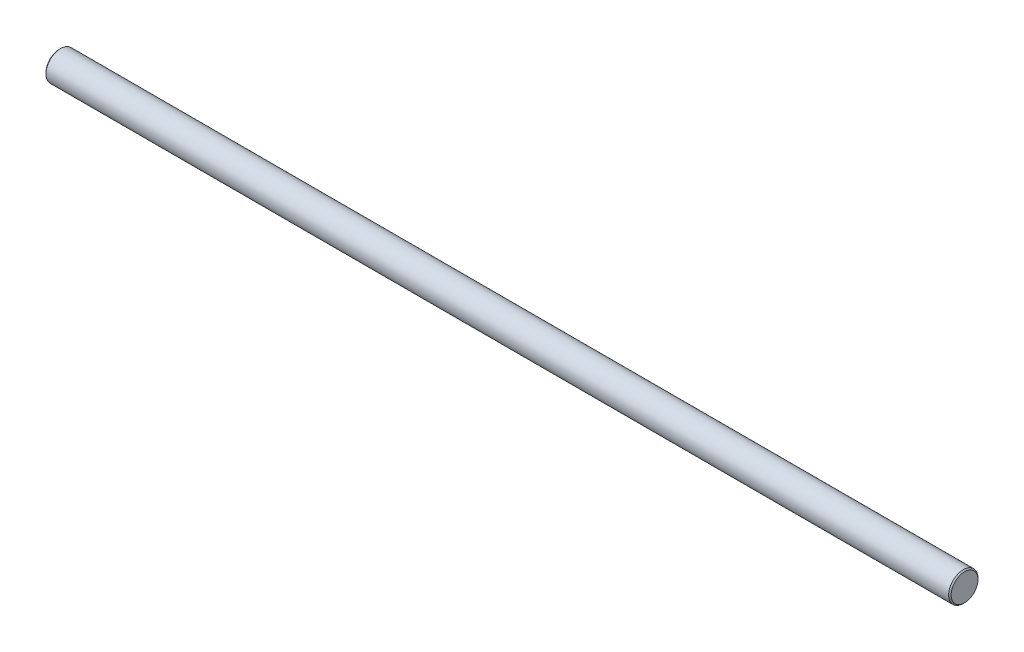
ISO-10303-21;
HEADER;
FILE_DESCRIPTION(('STEP AP214'),'2;1');
FILE_NAME('part.step','',(''),(''),'','','');
FILE_SCHEMA(('AUTOMOTIVE_DESIGN { 1 0 10303 214 1 1 1 1 }'));
ENDSEC;
DATA;
#1=APPLICATION_CONTEXT('core data for automotive mechanical design processes');
#2=APPLICATION_PROTOCOL_DEFINITION('international standard','automotive_design',2000,#1);
#3=PRODUCT_CONTEXT('',#1,'mechanical');
#4=PRODUCT('Part','Part','',(#3));
#5=PRODUCT_RELATED_PRODUCT_CATEGORY('part','',(#4));
#6=PRODUCT_DEFINITION_FORMATION('','',#4);
#7=PRODUCT_DEFINITION_CONTEXT('part definition',#1,'design');
#8=PRODUCT_DEFINITION('design','',#6,#7);
#9=PRODUCT_DEFINITION_SHAPE('','',#8);
#10=(LENGTH_UNIT() NAMED_UNIT(*) SI_UNIT(.MILLI.,.METRE.));
#11=(NAMED_UNIT(*) PLANE_ANGLE_UNIT() SI_UNIT($,.RADIAN.));
#12=(NAMED_UNIT(*) SI_UNIT($,.STERADIAN.) SOLID_ANGLE_UNIT());
#13=UNCERTAINTY_MEASURE_WITH_UNIT(LENGTH_MEASURE(1.E-05),#10,'distance_accuracy_value','');
#14=(GEOMETRIC_REPRESENTATION_CONTEXT(3) GLOBAL_UNCERTAINTY_ASSIGNED_CONTEXT((#13)) GLOBAL_UNIT_ASSIGNED_CONTEXT((#10,
#11,#12)) REPRESENTATION_CONTEXT('',''));
#15=CARTESIAN_POINT('',(0.,0.,0.));
#16=DIRECTION('',(0.,0.,1.));
#17=DIRECTION('',(1.,0.,0.));
#18=AXIS2_PLACEMENT_3D('',#15,#16,#17);
#19=CARTESIAN_POINT('',(185.,0.,0.));
#20=DIRECTION('',(-1.,0.,0.));
#21=DIRECTION('',(0.,0.,1.));
#22=AXIS2_PLACEMENT_3D('',#19,#20,#21);
#23=CYLINDRICAL_SURFACE('',#22,3.);
#24=CARTESIAN_POINT('',(0.249999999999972,0.,0.));
#25=DIRECTION('',(1.,0.,0.));
#26=DIRECTION('',(0.,0.,-1.));
#27=AXIS2_PLACEMENT_3D('',#24,#25,#26);
#28=CIRCLE('',#27,3.);
#29=CARTESIAN_POINT('',(0.249999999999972,0.,-3.));
#30=VERTEX_POINT('',#29);
#31=EDGE_CURVE('E40',#30,#30,#28,.T.);
#32=ORIENTED_EDGE('',*,*,#31,.T.);
#33=EDGE_LOOP('',(#32));
#34=FACE_BOUND('',#33,.T.);
#35=CARTESIAN_POINT('',(184.75,0.,0.));
#36=DIRECTION('',(1.,0.,0.));
#37=DIRECTION('',(0.,0.,-1.));
#38=AXIS2_PLACEMENT_3D('',#35,#36,#37);
#39=CIRCLE('',#38,3.);
#40=CARTESIAN_POINT('',(184.75,0.,-3.));
#41=VERTEX_POINT('',#40);
#42=EDGE_CURVE('E44',#41,#41,#39,.F.);
#43=ORIENTED_EDGE('',*,*,#42,.T.);
#44=EDGE_LOOP('',(#43));
#45=FACE_BOUND('',#44,.T.);
#46=ADVANCED_FACE('F29',(#34,#45),#23,.T.);
#47=CARTESIAN_POINT('',(185.,0.,0.));
#48=DIRECTION('',(1.,0.,0.));
#49=DIRECTION('',(0.,0.,-1.));
#50=AXIS2_PLACEMENT_3D('',#47,#48,#49);
#51=PLANE('',#50);
#52=CARTESIAN_POINT('',(185.,0.,0.));
#53=DIRECTION('',(1.,0.,0.));
#54=DIRECTION('',(0.,0.,-1.));
#55=AXIS2_PLACEMENT_3D('',#52,#53,#54);
#56=CIRCLE('',#55,2.75);
#57=CARTESIAN_POINT('',(185.,0.,-2.75));
#58=VERTEX_POINT('',#57);
#59=EDGE_CURVE('E10',#58,#58,#56,.T.);
#60=ORIENTED_EDGE('',*,*,#59,.T.);
#61=EDGE_LOOP('',(#60));
#62=FACE_BOUND('',#61,.T.);
#63=ADVANCED_FACE('F60',(#62),#51,.T.);
#64=CARTESIAN_POINT('',(0.,0.,0.));
#65=DIRECTION('',(1.,0.,0.));
#66=DIRECTION('',(0.,0.,-1.));
#67=AXIS2_PLACEMENT_3D('',#64,#65,#66);
#68=PLANE('',#67);
#69=CARTESIAN_POINT('',(0.,0.,0.));
#70=DIRECTION('',(1.,0.,0.));
#71=DIRECTION('',(0.,0.,-1.));
#72=AXIS2_PLACEMENT_3D('',#69,#70,#71);
#73=CIRCLE('',#72,2.75000000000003);
#74=CARTESIAN_POINT('',(0.,0.,-2.75000000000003));
#75=VERTEX_POINT('',#74);
#76=EDGE_CURVE('E36',#75,#75,#73,.F.);
#77=ORIENTED_EDGE('',*,*,#76,.T.);
#78=EDGE_LOOP('',(#77));
#79=FACE_BOUND('',#78,.T.);
#80=ADVANCED_FACE('F57',(#79),#68,.F.);
#81=CARTESIAN_POINT('',(0.249999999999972,0.,0.));
#82=DIRECTION('',(1.,0.,0.));
#83=DIRECTION('',(0.,0.,-1.));
#84=AXIS2_PLACEMENT_3D('',#81,#82,#83);
#85=CONICAL_SURFACE('',#84,3.,0.785398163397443);
#86=ORIENTED_EDGE('',*,*,#76,.F.);
#87=EDGE_LOOP('',(#86));
#88=FACE_BOUND('',#87,.T.);
#89=ORIENTED_EDGE('',*,*,#31,.F.);
#90=EDGE_LOOP('',(#89));
#91=FACE_BOUND('',#90,.T.);
#92=ADVANCED_FACE('F53',(#88,#91),#85,.T.);
#93=CARTESIAN_POINT('',(185.,0.,0.));
#94=DIRECTION('',(-1.,0.,0.));
#95=DIRECTION('',(0.,0.,1.));
#96=AXIS2_PLACEMENT_3D('',#93,#94,#95);
#97=CONICAL_SURFACE('',#96,2.75,0.785398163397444);
#98=ORIENTED_EDGE('',*,*,#42,.F.);
#99=EDGE_LOOP('',(#98));
#100=FACE_BOUND('',#99,.T.);
#101=ORIENTED_EDGE('',*,*,#59,.F.);
#102=EDGE_LOOP('',(#101));
#103=FACE_BOUND('',#102,.T.);
#104=ADVANCED_FACE('F31',(#100,#103),#97,.T.);
#105=CLOSED_SHELL('',(#46,#63,#80,#92,#104));
#106=MANIFOLD_SOLID_BREP('B2',#105);
#107=ADVANCED_BREP_SHAPE_REPRESENTATION('',(#18,#106),#14);
#108=SHAPE_DEFINITION_REPRESENTATION(#9,#107);
ENDSEC;
END-ISO-10303-21;
